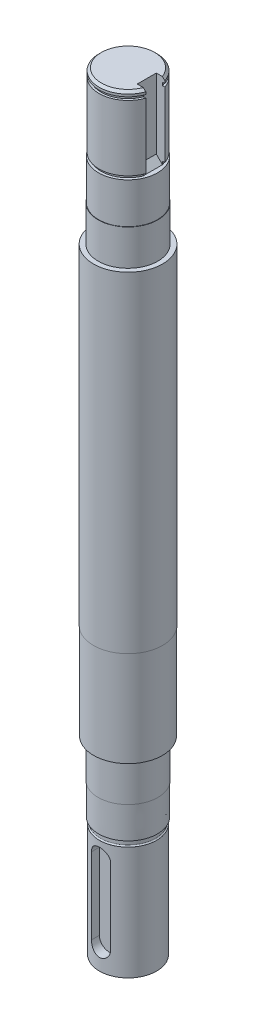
from build123d import *

# Parameters (mm, degrees)
CHAMFER_2_SIZE      = 1
CUT_EXTRUDE_1_DEPTH = 4
SKETCH_8_W          = 8
SKETCH_8_H          = 32
CUT_EXTRUDE_3_DEPTH = 4.3
CHAMFER_3_SIZE      = 2.6


with BuildPart() as part:
    # Sketch 1 → Revolve 2 (revolve)
    with BuildSketch(Plane.XY, mode=Mode.PRIVATE) as revolve_2_sk:
        Polygon((0, 0), (12, 0), (12, 50), (12.35, 50), (12.342707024, 63.3), (12.5, 63.3), (12.5, 79.5), (14.4, 79.5), (14.4, 119.5), (14.5, 119.5), (14.5, 258), (12.5, 258), (12.5, 273), (12.35, 273), (12.35, 290), (11.257292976, 290), (11.257292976, 291.3), (12.15, 291.3), (12.15, 318.7), (11.25, 318.7), (11.25, 320), (12.15, 320), (12.15, 322), (0, 322), align=None)
    revolve(revolve_2_sk.sketch.rotate(Axis((0, 326.056951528, 0), (0, 1, 0)), 90), axis=Axis((0, 326.056951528, 0), (0, 1, 0)))

    # Chamfer 2
    chamfer_2_edges = [part.edges().sort_by_distance(p)[0] for p in [
        (0, 322, 12.15),
    ]]
    chamfer(chamfer_2_edges, length=CHAMFER_2_SIZE)

    # Sketch 5 → Cut-Revolve 1 (revolve, cut)
    with BuildSketch(Plane.XY, mode=Mode.PRIVATE) as cut_revolve_1_sk:
        with BuildLine():
            Line((12, 50), (12, 47.5))
            Line((12, 47.5), (11.99, 47.5))
            ThreePointArc((11.99, 47.5), (11.643517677, 47.643517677), (11.5, 47.99))
            Line((11.5, 47.99), (11.5, 49.51))
            ThreePointArc((11.5, 49.51), (11.643517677, 49.856482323), (11.99, 50))
            Line((11.99, 50), (12, 50))
        make_face()
    revolve(cut_revolve_1_sk.sketch.rotate(Axis((0, 0, 0), (0, 1, 0)), 90), axis=Axis((0, 0, 0), (0, 1, 0)), mode=Mode.SUBTRACT)

    # Sketch 6 → Cut-Extrude 1 (cut)
    with BuildSketch(Plane.XY.offset(12)):
        with BuildLine():
            Line((-4, 9), (-4, 41))
            ThreePointArc((-4, 41), (0, 45), (4, 41))
            Line((4, 41), (4, 9))
            ThreePointArc((4, 9), (0, 5), (-4, 9))
        make_face()
    extrude(amount=-CUT_EXTRUDE_1_DEPTH, mode=Mode.SUBTRACT)

    # Sketch 8 → Cut-Extrude 3 (cut)
    with BuildSketch(Plane(origin=(12.15, 0, 0), x_dir=(0, 0, -1), z_dir=(1, 0, 0))):
        with Locations((0, 306)):
            Rectangle(SKETCH_8_W, SKETCH_8_H)
    extrude(amount=-CUT_EXTRUDE_3_DEPTH, mode=Mode.SUBTRACT)

    # Chamfer 3
    chamfer_3_edges = [part.edges().sort_by_distance(p)[0] for p in [
        (7.85, 290, 0),
    ]]
    chamfer(chamfer_3_edges, length=CHAMFER_3_SIZE)


solid = part.part
